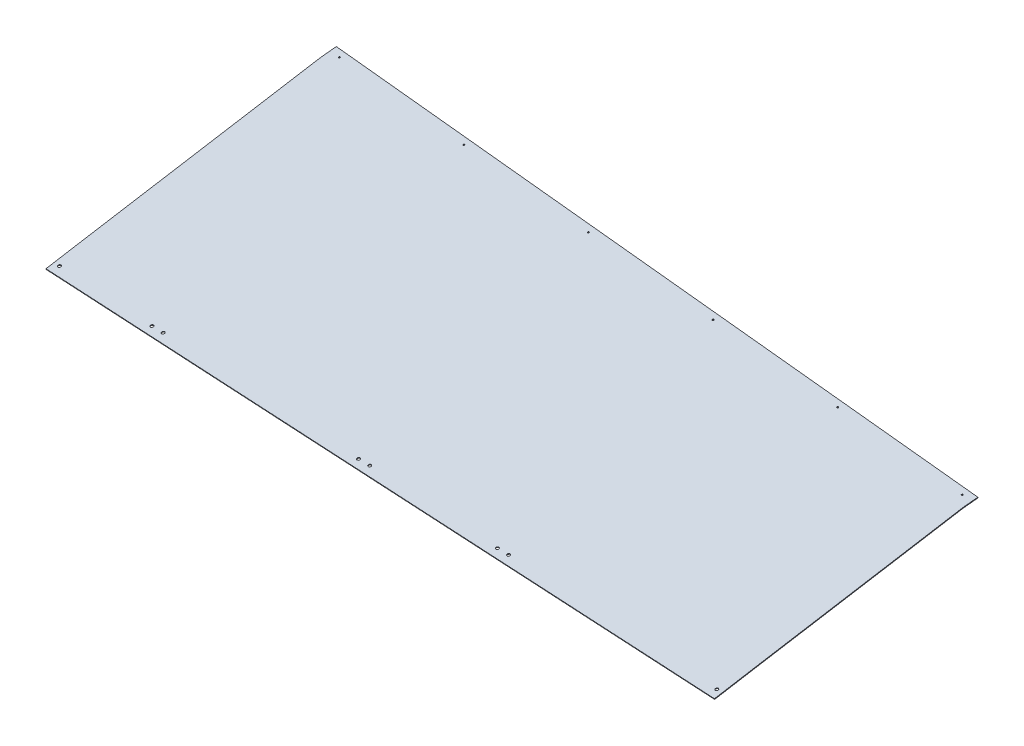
ISO-10303-21;
HEADER;
FILE_DESCRIPTION(('STEP AP214'),'2;1');
FILE_NAME('part.step','',(''),(''),'','','');
FILE_SCHEMA(('AUTOMOTIVE_DESIGN { 1 0 10303 214 1 1 1 1 }'));
ENDSEC;
DATA;
#1=APPLICATION_CONTEXT('core data for automotive mechanical design processes');
#2=APPLICATION_PROTOCOL_DEFINITION('international standard','automotive_design',2000,#1);
#3=PRODUCT_CONTEXT('',#1,'mechanical');
#4=PRODUCT('Part','Part','',(#3));
#5=PRODUCT_RELATED_PRODUCT_CATEGORY('part','',(#4));
#6=PRODUCT_DEFINITION_FORMATION('','',#4);
#7=PRODUCT_DEFINITION_CONTEXT('part definition',#1,'design');
#8=PRODUCT_DEFINITION('design','',#6,#7);
#9=PRODUCT_DEFINITION_SHAPE('','',#8);
#10=(LENGTH_UNIT() NAMED_UNIT(*) SI_UNIT(.MILLI.,.METRE.));
#11=(NAMED_UNIT(*) PLANE_ANGLE_UNIT() SI_UNIT($,.RADIAN.));
#12=(NAMED_UNIT(*) SI_UNIT($,.STERADIAN.) SOLID_ANGLE_UNIT());
#13=UNCERTAINTY_MEASURE_WITH_UNIT(LENGTH_MEASURE(1.E-05),#10,'distance_accuracy_value','');
#14=(GEOMETRIC_REPRESENTATION_CONTEXT(3) GLOBAL_UNCERTAINTY_ASSIGNED_CONTEXT((#13)) GLOBAL_UNIT_ASSIGNED_CONTEXT((#10,
#11,#12)) REPRESENTATION_CONTEXT('',''));
#15=CARTESIAN_POINT('',(0.,0.,0.));
#16=DIRECTION('',(0.,0.,1.));
#17=DIRECTION('',(1.,0.,0.));
#18=AXIS2_PLACEMENT_3D('',#15,#16,#17);
#19=CARTESIAN_POINT('',(6.04000777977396,-300.572395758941,-61.7927019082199));
#20=DIRECTION('',(-0.0196795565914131,0.979325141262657,0.201333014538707));
#21=DIRECTION('',(0.,-0.201372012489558,0.979514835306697));
#22=AXIS2_PLACEMENT_3D('',#19,#20,#21);
#23=PLANE('',#22);
#24=DIRECTION('',(0.0340234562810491,0.201911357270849,-0.978812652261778));
#25=VECTOR('',#24,1.);
#26=CARTESIAN_POINT('',(766.421113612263,-291.126825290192,-33.4134597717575));
#27=LINE('',#26,#25);
#28=CARTESIAN_POINT('',(793.756562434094,-128.905282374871,-819.820429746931));
#29=VERTEX_POINT('',#28);
#30=CARTESIAN_POINT('',(809.057878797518,-38.0999999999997,-1260.02032975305));
#31=VERTEX_POINT('',#30);
#32=EDGE_CURVE('E215',#29,#31,#27,.T.);
#33=ORIENTED_EDGE('',*,*,#32,.F.);
#34=DIRECTION('',(0.0276860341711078,0.201828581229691,-0.979029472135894));
#35=VECTOR('',#34,1.);
#36=CARTESIAN_POINT('',(793.739235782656,-129.031592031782,-819.207727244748));
#37=LINE('',#36,#35);
#38=CARTESIAN_POINT('',(793.739235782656,-129.031592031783,-819.207727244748));
#39=VERTEX_POINT('',#38);
#40=EDGE_CURVE('E142',#39,#29,#37,.T.);
#41=ORIENTED_EDGE('',*,*,#40,.F.);
#42=DIRECTION('',(0.0312390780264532,0.201875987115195,-0.978912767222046));
#43=VECTOR('',#42,1.);
#44=CARTESIAN_POINT('',(767.131724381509,-300.977051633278,14.5695242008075));
#45=LINE('',#44,#43);
#46=CARTESIAN_POINT('',(790.93331339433,-147.164276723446,-731.280892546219));
#47=VERTEX_POINT('',#46);
#48=EDGE_CURVE('E193',#47,#39,#45,.T.);
#49=ORIENTED_EDGE('',*,*,#48,.F.);
#50=DIRECTION('',(-0.998109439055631,-0.00751635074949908,-0.0610004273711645));
#51=VECTOR('',#50,1.);
#52=CARTESIAN_POINT('',(2449.4820662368,-134.674429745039,-629.917075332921));
#53=LINE('',#52,#51);
#54=CARTESIAN_POINT('',(-773.585829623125,-158.946025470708,-826.897998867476));
#55=VERTEX_POINT('',#54);
#56=EDGE_CURVE('E315',#47,#55,#53,.T.);
#57=ORIENTED_EDGE('',*,*,#56,.T.);
#58=DIRECTION('',(0.0312390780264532,0.201875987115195,-0.978912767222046));
#59=VECTOR('',#58,1.);
#60=CARTESIAN_POINT('',(-798.710337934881,-321.307888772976,-39.5923704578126));
#61=LINE('',#60,#59);
#62=CARTESIAN_POINT('',(-771.323454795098,-144.325902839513,-897.792139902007));
#63=VERTEX_POINT('',#62);
#64=EDGE_CURVE('E317',#55,#63,#61,.T.);
#65=ORIENTED_EDGE('',*,*,#64,.T.);
#66=DIRECTION('',(-0.0374160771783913,-0.201952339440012,0.978680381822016));
#67=VECTOR('',#66,1.);
#68=CARTESIAN_POINT('',(-771.30004215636,-144.199533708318,-898.404536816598));
#69=LINE('',#68,#67);
#70=CARTESIAN_POINT('',(-771.300042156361,-144.199533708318,-898.404536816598));
#71=VERTEX_POINT('',#70);
#72=EDGE_CURVE('E310',#71,#63,#69,.T.);
#73=ORIENTED_EDGE('',*,*,#72,.F.);
#74=DIRECTION('',(0.0340234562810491,0.201911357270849,-0.978812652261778));
#75=VECTOR('',#74,1.);
#76=CARTESIAN_POINT('',(-799.335775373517,-310.576896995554,-91.8512530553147));
#77=LINE('',#76,#75);
#78=CARTESIAN_POINT('',(-753.466675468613,-38.3678614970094,-1411.4483852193));
#79=VERTEX_POINT('',#78);
#80=EDGE_CURVE('E380',#71,#79,#77,.T.);
#81=ORIENTED_EDGE('',*,*,#80,.T.);
#82=DIRECTION('',(-0.0952713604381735,-0.202292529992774,0.974679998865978));
#83=VECTOR('',#82,1.);
#84=CARTESIAN_POINT('',(-753.275236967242,-37.9613743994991,-1413.40690955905));
#85=LINE('',#84,#83);
#86=CARTESIAN_POINT('',(-750.502674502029,-32.0743095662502,-1441.77179453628));
#87=VERTEX_POINT('',#86);
#88=EDGE_CURVE('E224',#87,#79,#85,.T.);
#89=ORIENTED_EDGE('',*,*,#88,.F.);
#90=DIRECTION('',(-0.995256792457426,0.,-0.0972826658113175));
#91=VECTOR('',#90,1.);
#92=CARTESIAN_POINT('',(-2549.86215064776,-32.0743095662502,-1617.65251991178));
#93=LINE('',#92,#91);
#94=CARTESIAN_POINT('',(811.895728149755,-32.0743095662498,-1289.05313657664));
#95=VERTEX_POINT('',#94);
#96=EDGE_CURVE('E259',#95,#87,#93,.T.);
#97=ORIENTED_EDGE('',*,*,#96,.F.);
#98=DIRECTION('',(0.095271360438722,0.202292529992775,-0.974679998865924));
#99=VECTOR('',#98,1.);
#100=CARTESIAN_POINT('',(809.057878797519,-38.0999999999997,-1260.02032975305));
#101=LINE('',#100,#99);
#102=EDGE_CURVE('E257',#31,#95,#101,.T.);
#103=ORIENTED_EDGE('',*,*,#102,.F.);
#104=EDGE_LOOP('',(#33,#41,#49,#57,#65,#73,#81,#89,#97,#103));
#105=FACE_BOUND('',#104,.T.);
#106=CARTESIAN_POINT('',(-760.215047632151,-155.332930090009,-843.165892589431));
#107=DIRECTION('',(0.0196795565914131,-0.979325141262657,-0.201333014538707));
#108=DIRECTION('',(-0.00344658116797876,0.201304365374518,-0.979522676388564));
#109=AXIS2_PLACEMENT_3D('',#106,#107,#108);
#110=CIRCLE('',#109,3.17500000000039);
#111=CARTESIAN_POINT('',(-760.225990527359,-154.693788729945,-846.275877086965));
#112=VERTEX_POINT('',#111);
#113=EDGE_CURVE('E332',#112,#112,#110,.T.);
#114=ORIENTED_EDGE('',*,*,#113,.F.);
#115=EDGE_LOOP('',(#114));
#116=FACE_BOUND('',#115,.T.);
#117=CARTESIAN_POINT('',(-543.073211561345,-153.849423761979,-829.157161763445));
#118=DIRECTION('',(0.0196795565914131,-0.979325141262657,-0.201333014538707));
#119=DIRECTION('',(-0.00344658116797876,0.201304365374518,-0.979522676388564));
#120=AXIS2_PLACEMENT_3D('',#117,#118,#119);
#121=CIRCLE('',#120,3.17500000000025);
#122=CARTESIAN_POINT('',(-543.084154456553,-153.210282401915,-832.267146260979));
#123=VERTEX_POINT('',#122);
#124=EDGE_CURVE('E338',#123,#123,#121,.T.);
#125=ORIENTED_EDGE('',*,*,#124,.F.);
#126=EDGE_LOOP('',(#125));
#127=FACE_BOUND('',#126,.T.);
#128=CARTESIAN_POINT('',(-517.688558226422,-153.506566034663,-828.343636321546));
#129=DIRECTION('',(0.0196795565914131,-0.979325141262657,-0.201333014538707));
#130=DIRECTION('',(-0.00344658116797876,0.201304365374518,-0.979522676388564));
#131=AXIS2_PLACEMENT_3D('',#128,#129,#130);
#132=CIRCLE('',#131,3.17500000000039);
#133=CARTESIAN_POINT('',(-517.69950112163,-152.867424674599,-831.45362081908));
#134=VERTEX_POINT('',#133);
#135=EDGE_CURVE('E344',#134,#134,#132,.T.);
#136=ORIENTED_EDGE('',*,*,#135,.F.);
#137=EDGE_LOOP('',(#136));
#138=FACE_BOUND('',#137,.T.);
#139=CARTESIAN_POINT('',(-59.605373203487,-150.208632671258,-799.609526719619));
#140=DIRECTION('',(0.0196795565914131,-0.979325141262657,-0.201333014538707));
#141=DIRECTION('',(-0.00344658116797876,0.201304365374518,-0.979522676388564));
#142=AXIS2_PLACEMENT_3D('',#139,#140,#141);
#143=CIRCLE('',#142,3.17500000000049);
#144=CARTESIAN_POINT('',(-59.6163160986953,-149.569491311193,-802.719511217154));
#145=VERTEX_POINT('',#144);
#146=EDGE_CURVE('E350',#145,#145,#143,.T.);
#147=ORIENTED_EDGE('',*,*,#146,.F.);
#148=EDGE_LOOP('',(#147));
#149=FACE_BOUND('',#148,.T.);
#150=CARTESIAN_POINT('',(-34.2207198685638,-149.865774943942,-798.796001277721));
#151=DIRECTION('',(0.0196795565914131,-0.979325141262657,-0.201333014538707));
#152=DIRECTION('',(-0.00344658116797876,0.201304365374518,-0.979522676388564));
#153=AXIS2_PLACEMENT_3D('',#150,#151,#152);
#154=CIRCLE('',#153,3.17500000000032);
#155=CARTESIAN_POINT('',(-34.2316627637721,-149.226633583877,-801.905985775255));
#156=VERTEX_POINT('',#155);
#157=EDGE_CURVE('E356',#156,#156,#154,.T.);
#158=ORIENTED_EDGE('',*,*,#157,.F.);
#159=EDGE_LOOP('',(#158));
#160=FACE_BOUND('',#159,.T.);
#161=CARTESIAN_POINT('',(265.348419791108,-147.761543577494,-779.749640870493));
#162=DIRECTION('',(0.0196795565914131,-0.979325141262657,-0.201333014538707));
#163=DIRECTION('',(-0.00344658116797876,0.201304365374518,-0.979522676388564));
#164=AXIS2_PLACEMENT_3D('',#161,#162,#163);
#165=CIRCLE('',#164,3.17500000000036);
#166=CARTESIAN_POINT('',(265.337476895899,-147.12240221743,-782.859625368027));
#167=VERTEX_POINT('',#166);
#168=EDGE_CURVE('E362',#167,#167,#165,.T.);
#169=ORIENTED_EDGE('',*,*,#168,.F.);
#170=EDGE_LOOP('',(#169));
#171=FACE_BOUND('',#170,.T.);
#172=CARTESIAN_POINT('',(290.733073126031,-147.418685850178,-778.936115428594));
#173=DIRECTION('',(0.0196795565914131,-0.979325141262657,-0.201333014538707));
#174=DIRECTION('',(-0.00344658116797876,0.201304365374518,-0.979522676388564));
#175=AXIS2_PLACEMENT_3D('',#172,#173,#174);
#176=CIRCLE('',#175,3.17500000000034);
#177=CARTESIAN_POINT('',(290.722130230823,-146.779544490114,-782.046099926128));
#178=VERTEX_POINT('',#177);
#179=EDGE_CURVE('E368',#178,#178,#176,.T.);
#180=ORIENTED_EDGE('',*,*,#179,.F.);
#181=EDGE_LOOP('',(#180));
#182=FACE_BOUND('',#181,.T.);
#183=CARTESIAN_POINT('',(778.933926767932,-143.893949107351,-748.361333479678));
#184=DIRECTION('',(0.0196795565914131,-0.979325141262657,-0.201333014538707));
#185=DIRECTION('',(-0.00344658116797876,0.201304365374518,-0.979522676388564));
#186=AXIS2_PLACEMENT_3D('',#183,#184,#185);
#187=CIRCLE('',#186,3.17500000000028);
#188=CARTESIAN_POINT('',(778.922983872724,-143.254807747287,-751.471317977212));
#189=VERTEX_POINT('',#188);
#190=EDGE_CURVE('E374',#189,#189,#187,.T.);
#191=ORIENTED_EDGE('',*,*,#190,.F.);
#192=EDGE_LOOP('',(#191));
#193=FACE_BOUND('',#192,.T.);
#194=CARTESIAN_POINT('',(-729.09669704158,-34.6434246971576,-1427.18273575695));
#195=DIRECTION('',(0.0196795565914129,-0.979325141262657,-0.201333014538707));
#196=DIRECTION('',(-0.995256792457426,0.,-0.0972826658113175));
#197=AXIS2_PLACEMENT_3D('',#194,#195,#196);
#198=CIRCLE('',#197,1.58750000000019);
#199=CARTESIAN_POINT('',(-730.676667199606,-34.6434246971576,-1427.33717198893));
#200=VERTEX_POINT('',#199);
#201=EDGE_CURVE('E470',#200,#200,#198,.T.);
#202=ORIENTED_EDGE('',*,*,#201,.F.);
#203=EDGE_LOOP('',(#202));
#204=FACE_BOUND('',#203,.T.);
#205=CARTESIAN_POINT('',(-425.742426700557,-34.6434246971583,-1397.53097921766));
#206=DIRECTION('',(0.0196795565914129,-0.979325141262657,-0.201333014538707));
#207=DIRECTION('',(-0.995256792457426,0.,-0.0972826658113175));
#208=AXIS2_PLACEMENT_3D('',#205,#206,#207);
#209=CIRCLE('',#208,1.58749999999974);
#210=CARTESIAN_POINT('',(-427.322396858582,-34.6434246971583,-1397.68541544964));
#211=VERTEX_POINT('',#210);
#212=EDGE_CURVE('E474',#211,#211,#209,.T.);
#213=ORIENTED_EDGE('',*,*,#212,.F.);
#214=EDGE_LOOP('',(#213));
#215=FACE_BOUND('',#214,.T.);
#216=CARTESIAN_POINT('',(-122.388156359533,-34.643424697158,-1367.87922267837));
#217=DIRECTION('',(0.0196795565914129,-0.979325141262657,-0.201333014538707));
#218=DIRECTION('',(-0.995256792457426,0.,-0.0972826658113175));
#219=AXIS2_PLACEMENT_3D('',#216,#217,#218);
#220=CIRCLE('',#219,1.58750000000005);
#221=CARTESIAN_POINT('',(-123.968126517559,-34.643424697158,-1368.03365891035));
#222=VERTEX_POINT('',#221);
#223=EDGE_CURVE('E478',#222,#222,#220,.T.);
#224=ORIENTED_EDGE('',*,*,#223,.F.);
#225=EDGE_LOOP('',(#224));
#226=FACE_BOUND('',#225,.T.);
#227=CARTESIAN_POINT('',(180.96611398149,-34.6434246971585,-1338.22746613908));
#228=DIRECTION('',(0.0196795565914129,-0.979325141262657,-0.201333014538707));
#229=DIRECTION('',(-0.995256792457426,0.,-0.0972826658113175));
#230=AXIS2_PLACEMENT_3D('',#227,#228,#229);
#231=CIRCLE('',#230,1.58750000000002);
#232=CARTESIAN_POINT('',(179.386143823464,-34.6434246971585,-1338.38190237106));
#233=VERTEX_POINT('',#232);
#234=EDGE_CURVE('E482',#233,#233,#231,.T.);
#235=ORIENTED_EDGE('',*,*,#234,.F.);
#236=EDGE_LOOP('',(#235));
#237=FACE_BOUND('',#236,.T.);
#238=CARTESIAN_POINT('',(484.320384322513,-34.6434246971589,-1308.57570959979));
#239=DIRECTION('',(0.0196795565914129,-0.979325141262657,-0.201333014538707));
#240=DIRECTION('',(-0.995256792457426,0.,-0.0972826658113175));
#241=AXIS2_PLACEMENT_3D('',#238,#239,#240);
#242=CIRCLE('',#241,1.58749999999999);
#243=CARTESIAN_POINT('',(482.740414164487,-34.6434246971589,-1308.73014583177));
#244=VERTEX_POINT('',#243);
#245=EDGE_CURVE('E262',#244,#244,#242,.T.);
#246=ORIENTED_EDGE('',*,*,#245,.F.);
#247=EDGE_LOOP('',(#246));
#248=FACE_BOUND('',#247,.T.);
#249=CARTESIAN_POINT('',(787.674654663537,-34.6434246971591,-1278.9239530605));
#250=DIRECTION('',(0.0196795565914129,-0.979325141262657,-0.201333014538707));
#251=DIRECTION('',(-0.995256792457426,0.,-0.0972826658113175));
#252=AXIS2_PLACEMENT_3D('',#249,#250,#251);
#253=CIRCLE('',#252,1.58749999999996);
#254=CARTESIAN_POINT('',(786.094684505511,-34.6434246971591,-1279.07838929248));
#255=VERTEX_POINT('',#254);
#256=EDGE_CURVE('E258',#255,#255,#253,.T.);
#257=ORIENTED_EDGE('',*,*,#256,.F.);
#258=EDGE_LOOP('',(#257));
#259=FACE_BOUND('',#258,.T.);
#260=ADVANCED_FACE('F125',(#105,#116,#127,#138,#149,#160,#171,#182,#193,#204,#215,#226,#237,
#248,#259),#23,.F.);
#261=CARTESIAN_POINT('',(-865.89373133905,3001.58510855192,589.074348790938));
#262=DIRECTION('',(-0.999227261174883,-0.0124125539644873,-0.037293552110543));
#263=DIRECTION('',(-0.0372964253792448,0.,0.999304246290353));
#264=AXIS2_PLACEMENT_3D('',#261,#262,#263);
#265=PLANE('',#264);
#266=ORIENTED_EDGE('',*,*,#80,.F.);
#267=CARTESIAN_POINT('',(-771.30004215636,-144.199533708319,-898.404536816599));
#268=DIRECTION('',(-0.0196795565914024,0.979325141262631,0.201333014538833));
#269=VECTOR('',#268,1.);
#270=LINE('',#267,#269);
#271=CARTESIAN_POINT('',(-771.332033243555,-142.607542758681,-898.077249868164));
#272=VERTEX_POINT('',#271);
#273=EDGE_CURVE('E136',#71,#272,#270,.T.);
#274=ORIENTED_EDGE('',*,*,#273,.T.);
#275=DIRECTION('',(0.0340234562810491,0.201911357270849,-0.978812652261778));
#276=VECTOR('',#275,1.);
#277=CARTESIAN_POINT('',(-799.367766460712,-308.984906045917,-91.5239661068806));
#278=LINE('',#277,#276);
#279=CARTESIAN_POINT('',(-753.498666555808,-36.7758705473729,-1411.12109827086));
#280=VERTEX_POINT('',#279);
#281=EDGE_CURVE('E204',#272,#280,#278,.T.);
#282=ORIENTED_EDGE('',*,*,#281,.T.);
#283=DIRECTION('',(-0.0196795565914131,0.979325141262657,0.201333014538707));
#284=VECTOR('',#283,1.);
#285=CARTESIAN_POINT('',(-753.482671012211,-37.5718660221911,-1411.28474174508));
#286=LINE('',#285,#284);
#287=EDGE_CURVE('E267',#79,#280,#286,.T.);
#288=ORIENTED_EDGE('',*,*,#287,.F.);
#289=EDGE_LOOP('',(#266,#274,#282,#288));
#290=FACE_BOUND('',#289,.T.);
#291=ADVANCED_FACE('F409',(#290),#265,.T.);
#292=CARTESIAN_POINT('',(699.86315764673,3021.03518025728,647.512142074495));
#293=DIRECTION('',(-0.999227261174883,-0.0124125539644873,-0.037293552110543));
#294=DIRECTION('',(-0.0372964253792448,0.,0.999304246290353));
#295=AXIS2_PLACEMENT_3D('',#292,#293,#294);
#296=PLANE('',#295);
#297=CARTESIAN_POINT('',(793.756562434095,-128.905282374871,-819.820429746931));
#298=DIRECTION('',(-0.0196795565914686,0.979325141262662,0.201333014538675));
#299=VECTOR('',#298,1.);
#300=LINE('',#297,#299);
#301=CARTESIAN_POINT('',(793.724571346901,-127.313291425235,-819.493142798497));
#302=VERTEX_POINT('',#301);
#303=EDGE_CURVE('E13',#29,#302,#300,.T.);
#304=ORIENTED_EDGE('',*,*,#303,.F.);
#305=ORIENTED_EDGE('',*,*,#32,.T.);
#306=DIRECTION('',(-0.0196795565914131,0.979325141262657,0.201333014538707));
#307=VECTOR('',#306,1.);
#308=CARTESIAN_POINT('',(809.041883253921,-37.3040045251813,-1259.85668627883));
#309=LINE('',#308,#307);
#310=CARTESIAN_POINT('',(809.025887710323,-36.5080090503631,-1259.69304280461));
#311=VERTEX_POINT('',#310);
#312=EDGE_CURVE('E271',#31,#311,#309,.T.);
#313=ORIENTED_EDGE('',*,*,#312,.T.);
#314=DIRECTION('',(0.0340234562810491,0.201911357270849,-0.978812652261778));
#315=VECTOR('',#314,1.);
#316=CARTESIAN_POINT('',(766.389122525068,-289.534834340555,-33.0861728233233));
#317=LINE('',#316,#315);
#318=EDGE_CURVE('E242',#302,#311,#317,.T.);
#319=ORIENTED_EDGE('',*,*,#318,.F.);
#320=EDGE_LOOP('',(#304,#305,#313,#319));
#321=FACE_BOUND('',#320,.T.);
#322=ADVANCED_FACE('F400',(#321),#296,.F.);
#323=CARTESIAN_POINT('',(6.00801669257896,-298.980404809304,-61.4654149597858));
#324=DIRECTION('',(-0.0196795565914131,0.979325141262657,0.201333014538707));
#325=DIRECTION('',(0.,-0.201372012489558,0.979514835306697));
#326=AXIS2_PLACEMENT_3D('',#323,#324,#325);
#327=PLANE('',#326);
#328=ORIENTED_EDGE('',*,*,#281,.F.);
#329=DIRECTION('',(-0.0374160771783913,-0.201952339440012,0.978680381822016));
#330=VECTOR('',#329,1.);
#331=CARTESIAN_POINT('',(-771.332033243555,-142.607542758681,-898.077249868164));
#332=LINE('',#331,#330);
#333=CARTESIAN_POINT('',(-771.355445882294,-142.733911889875,-897.464852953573));
#334=VERTEX_POINT('',#333);
#335=EDGE_CURVE('E421',#272,#334,#332,.T.);
#336=ORIENTED_EDGE('',*,*,#335,.T.);
#337=DIRECTION('',(0.0312390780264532,0.201875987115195,-0.978912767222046));
#338=VECTOR('',#337,1.);
#339=CARTESIAN_POINT('',(-798.742329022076,-319.715897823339,-39.2650835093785));
#340=LINE('',#339,#338);
#341=CARTESIAN_POINT('',(-773.61782071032,-157.354034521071,-826.570711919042));
#342=VERTEX_POINT('',#341);
#343=EDGE_CURVE('E151',#342,#334,#340,.T.);
#344=ORIENTED_EDGE('',*,*,#343,.F.);
#345=DIRECTION('',(-0.998109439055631,-0.00751635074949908,-0.0610004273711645));
#346=VECTOR('',#345,1.);
#347=CARTESIAN_POINT('',(2449.4500751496,-133.082438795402,-629.589788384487));
#348=LINE('',#347,#346);
#349=CARTESIAN_POINT('',(790.901322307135,-145.572285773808,-730.953605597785));
#350=VERTEX_POINT('',#349);
#351=EDGE_CURVE('E330',#350,#342,#348,.T.);
#352=ORIENTED_EDGE('',*,*,#351,.F.);
#353=DIRECTION('',(0.0312390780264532,0.201875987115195,-0.978912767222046));
#354=VECTOR('',#353,1.);
#355=CARTESIAN_POINT('',(767.099733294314,-299.385060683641,14.8968111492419));
#356=LINE('',#355,#354);
#357=CARTESIAN_POINT('',(793.707244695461,-127.439601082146,-818.880440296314));
#358=VERTEX_POINT('',#357);
#359=EDGE_CURVE('E175',#350,#358,#356,.T.);
#360=ORIENTED_EDGE('',*,*,#359,.T.);
#361=DIRECTION('',(0.0276860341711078,0.201828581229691,-0.979029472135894));
#362=VECTOR('',#361,1.);
#363=CARTESIAN_POINT('',(793.707244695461,-127.439601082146,-818.880440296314));
#364=LINE('',#363,#362);
#365=EDGE_CURVE('E385',#358,#302,#364,.T.);
#366=ORIENTED_EDGE('',*,*,#365,.T.);
#367=ORIENTED_EDGE('',*,*,#318,.T.);
#368=DIRECTION('',(0.095271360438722,0.202292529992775,-0.974679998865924));
#369=VECTOR('',#368,1.);
#370=CARTESIAN_POINT('',(809.025887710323,-36.5080090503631,-1259.69304280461));
#371=LINE('',#370,#369);
#372=CARTESIAN_POINT('',(811.86373706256,-30.4823186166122,-1288.7258496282));
#373=VERTEX_POINT('',#372);
#374=EDGE_CURVE('E235',#311,#373,#371,.T.);
#375=ORIENTED_EDGE('',*,*,#374,.T.);
#376=DIRECTION('',(-0.995256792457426,0.,-0.0972826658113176));
#377=VECTOR('',#376,1.);
#378=CARTESIAN_POINT('',(132.459438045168,-30.4823186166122,-1355.13510387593));
#379=LINE('',#378,#377);
#380=CARTESIAN_POINT('',(-750.534665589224,-30.4823186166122,-1441.44450758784));
#381=VERTEX_POINT('',#380);
#382=EDGE_CURVE('E239',#373,#381,#379,.T.);
#383=ORIENTED_EDGE('',*,*,#382,.T.);
#384=DIRECTION('',(-0.0952713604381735,-0.202292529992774,0.974679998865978));
#385=VECTOR('',#384,1.);
#386=CARTESIAN_POINT('',(-753.307228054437,-36.3693834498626,-1413.07962261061));
#387=LINE('',#386,#385);
#388=EDGE_CURVE('E245',#381,#280,#387,.T.);
#389=ORIENTED_EDGE('',*,*,#388,.T.);
#390=EDGE_LOOP('',(#328,#336,#344,#352,#360,#366,#367,#375,#383,#389));
#391=FACE_BOUND('',#390,.T.);
#392=CARTESIAN_POINT('',(-760.247038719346,-153.740939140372,-842.838605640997));
#393=DIRECTION('',(-0.0196795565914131,0.979325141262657,0.201333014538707));
#394=DIRECTION('',(0.00344658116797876,-0.201304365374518,0.979522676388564));
#395=AXIS2_PLACEMENT_3D('',#392,#393,#394);
#396=CIRCLE('',#395,3.17500000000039);
#397=CARTESIAN_POINT('',(-760.236095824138,-154.380080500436,-839.728621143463));
#398=VERTEX_POINT('',#397);
#399=EDGE_CURVE('E335',#398,#398,#396,.T.);
#400=ORIENTED_EDGE('',*,*,#399,.F.);
#401=EDGE_LOOP('',(#400));
#402=FACE_BOUND('',#401,.T.);
#403=CARTESIAN_POINT('',(-543.10520264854,-152.257432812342,-828.829874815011));
#404=DIRECTION('',(-0.0196795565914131,0.979325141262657,0.201333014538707));
#405=DIRECTION('',(0.00344658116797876,-0.201304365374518,0.979522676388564));
#406=AXIS2_PLACEMENT_3D('',#403,#404,#405);
#407=CIRCLE('',#406,3.17500000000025);
#408=CARTESIAN_POINT('',(-543.094259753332,-152.896574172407,-825.719890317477));
#409=VERTEX_POINT('',#408);
#410=EDGE_CURVE('E341',#409,#409,#407,.T.);
#411=ORIENTED_EDGE('',*,*,#410,.F.);
#412=EDGE_LOOP('',(#411));
#413=FACE_BOUND('',#412,.T.);
#414=CARTESIAN_POINT('',(-517.720549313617,-151.914575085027,-828.016349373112));
#415=DIRECTION('',(-0.0196795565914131,0.979325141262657,0.201333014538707));
#416=DIRECTION('',(0.00344658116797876,-0.201304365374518,0.979522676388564));
#417=AXIS2_PLACEMENT_3D('',#414,#415,#416);
#418=CIRCLE('',#417,3.17500000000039);
#419=CARTESIAN_POINT('',(-517.709606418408,-152.553716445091,-824.906364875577));
#420=VERTEX_POINT('',#419);
#421=EDGE_CURVE('E347',#420,#420,#418,.T.);
#422=ORIENTED_EDGE('',*,*,#421,.F.);
#423=EDGE_LOOP('',(#422));
#424=FACE_BOUND('',#423,.T.);
#425=CARTESIAN_POINT('',(-59.637364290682,-148.616641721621,-799.282239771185));
#426=DIRECTION('',(-0.0196795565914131,0.979325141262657,0.201333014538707));
#427=DIRECTION('',(0.00344658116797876,-0.201304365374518,0.979522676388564));
#428=AXIS2_PLACEMENT_3D('',#425,#426,#427);
#429=CIRCLE('',#428,3.17500000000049);
#430=CARTESIAN_POINT('',(-59.6264213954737,-149.255783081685,-796.172255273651));
#431=VERTEX_POINT('',#430);
#432=EDGE_CURVE('E353',#431,#431,#429,.T.);
#433=ORIENTED_EDGE('',*,*,#432,.F.);
#434=EDGE_LOOP('',(#433));
#435=FACE_BOUND('',#434,.T.);
#436=CARTESIAN_POINT('',(-34.2527109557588,-148.273783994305,-798.468714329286));
#437=DIRECTION('',(-0.0196795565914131,0.979325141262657,0.201333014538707));
#438=DIRECTION('',(0.00344658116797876,-0.201304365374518,0.979522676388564));
#439=AXIS2_PLACEMENT_3D('',#436,#437,#438);
#440=CIRCLE('',#439,3.17500000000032);
#441=CARTESIAN_POINT('',(-34.2417680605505,-148.912925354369,-795.358729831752));
#442=VERTEX_POINT('',#441);
#443=EDGE_CURVE('E359',#442,#442,#440,.T.);
#444=ORIENTED_EDGE('',*,*,#443,.F.);
#445=EDGE_LOOP('',(#444));
#446=FACE_BOUND('',#445,.T.);
#447=CARTESIAN_POINT('',(265.316428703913,-146.169552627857,-779.422353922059));
#448=DIRECTION('',(-0.0196795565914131,0.979325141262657,0.201333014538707));
#449=DIRECTION('',(0.00344658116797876,-0.201304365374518,0.979522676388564));
#450=AXIS2_PLACEMENT_3D('',#447,#448,#449);
#451=CIRCLE('',#450,3.17500000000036);
#452=CARTESIAN_POINT('',(265.327371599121,-146.808693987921,-776.312369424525));
#453=VERTEX_POINT('',#452);
#454=EDGE_CURVE('E365',#453,#453,#451,.T.);
#455=ORIENTED_EDGE('',*,*,#454,.F.);
#456=EDGE_LOOP('',(#455));
#457=FACE_BOUND('',#456,.T.);
#458=CARTESIAN_POINT('',(290.701082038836,-145.826694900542,-778.608828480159));
#459=DIRECTION('',(-0.0196795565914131,0.979325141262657,0.201333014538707));
#460=DIRECTION('',(0.00344658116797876,-0.201304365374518,0.979522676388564));
#461=AXIS2_PLACEMENT_3D('',#458,#459,#460);
#462=CIRCLE('',#461,3.17500000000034);
#463=CARTESIAN_POINT('',(290.712024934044,-146.465836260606,-775.498843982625));
#464=VERTEX_POINT('',#463);
#465=EDGE_CURVE('E371',#464,#464,#462,.T.);
#466=ORIENTED_EDGE('',*,*,#465,.F.);
#467=EDGE_LOOP('',(#466));
#468=FACE_BOUND('',#467,.T.);
#469=CARTESIAN_POINT('',(778.901935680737,-142.301958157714,-748.034046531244));
#470=DIRECTION('',(-0.0196795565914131,0.979325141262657,0.201333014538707));
#471=DIRECTION('',(0.00344658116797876,-0.201304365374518,0.979522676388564));
#472=AXIS2_PLACEMENT_3D('',#469,#470,#471);
#473=CIRCLE('',#472,3.17500000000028);
#474=CARTESIAN_POINT('',(778.912878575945,-142.941099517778,-744.92406203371));
#475=VERTEX_POINT('',#474);
#476=EDGE_CURVE('E377',#475,#475,#473,.T.);
#477=ORIENTED_EDGE('',*,*,#476,.F.);
#478=EDGE_LOOP('',(#477));
#479=FACE_BOUND('',#478,.T.);
#480=CARTESIAN_POINT('',(-729.128688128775,-33.051433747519,-1426.85544880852));
#481=DIRECTION('',(0.019679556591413,-0.979325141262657,-0.201333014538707));
#482=DIRECTION('',(-0.995256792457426,0.,-0.0972826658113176));
#483=AXIS2_PLACEMENT_3D('',#480,#481,#482);
#484=CIRCLE('',#483,1.58750000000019);
#485=CARTESIAN_POINT('',(-730.708658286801,-33.051433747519,-1427.0098850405));
#486=VERTEX_POINT('',#485);
#487=EDGE_CURVE('E511',#486,#486,#484,.T.);
#488=ORIENTED_EDGE('',*,*,#487,.T.);
#489=EDGE_LOOP('',(#488));
#490=FACE_BOUND('',#489,.T.);
#491=CARTESIAN_POINT('',(-425.774417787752,-33.0514337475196,-1397.20369226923));
#492=DIRECTION('',(0.019679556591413,-0.979325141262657,-0.201333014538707));
#493=DIRECTION('',(-0.995256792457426,0.,-0.0972826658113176));
#494=AXIS2_PLACEMENT_3D('',#491,#492,#493);
#495=CIRCLE('',#494,1.58749999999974);
#496=CARTESIAN_POINT('',(-427.354387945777,-33.0514337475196,-1397.3581285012));
#497=VERTEX_POINT('',#496);
#498=EDGE_CURVE('E508',#497,#497,#495,.T.);
#499=ORIENTED_EDGE('',*,*,#498,.T.);
#500=EDGE_LOOP('',(#499));
#501=FACE_BOUND('',#500,.T.);
#502=CARTESIAN_POINT('',(-122.420147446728,-33.0514337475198,-1367.55193572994));
#503=DIRECTION('',(0.019679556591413,-0.979325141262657,-0.201333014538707));
#504=DIRECTION('',(-0.995256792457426,0.,-0.0972826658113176));
#505=AXIS2_PLACEMENT_3D('',#502,#503,#504);
#506=CIRCLE('',#505,1.58750000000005);
#507=CARTESIAN_POINT('',(-124.000117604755,-33.0514337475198,-1367.70637196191));
#508=VERTEX_POINT('',#507);
#509=EDGE_CURVE('E505',#508,#508,#506,.T.);
#510=ORIENTED_EDGE('',*,*,#509,.T.);
#511=EDGE_LOOP('',(#510));
#512=FACE_BOUND('',#511,.T.);
#513=CARTESIAN_POINT('',(180.934122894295,-33.0514337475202,-1337.90017919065));
#514=DIRECTION('',(0.019679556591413,-0.979325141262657,-0.201333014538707));
#515=DIRECTION('',(-0.995256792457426,0.,-0.0972826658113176));
#516=AXIS2_PLACEMENT_3D('',#513,#514,#515);
#517=CIRCLE('',#516,1.58750000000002);
#518=CARTESIAN_POINT('',(179.354152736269,-33.0514337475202,-1338.05461542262));
#519=VERTEX_POINT('',#518);
#520=EDGE_CURVE('E499',#519,#519,#517,.T.);
#521=ORIENTED_EDGE('',*,*,#520,.T.);
#522=EDGE_LOOP('',(#521));
#523=FACE_BOUND('',#522,.T.);
#524=CARTESIAN_POINT('',(484.288393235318,-33.0514337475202,-1308.24842265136));
#525=DIRECTION('',(0.019679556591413,-0.979325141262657,-0.201333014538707));
#526=DIRECTION('',(-0.995256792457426,0.,-0.0972826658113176));
#527=AXIS2_PLACEMENT_3D('',#524,#525,#526);
#528=CIRCLE('',#527,1.58749999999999);
#529=CARTESIAN_POINT('',(482.708423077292,-33.0514337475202,-1308.40285888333));
#530=VERTEX_POINT('',#529);
#531=EDGE_CURVE('E496',#530,#530,#528,.T.);
#532=ORIENTED_EDGE('',*,*,#531,.T.);
#533=EDGE_LOOP('',(#532));
#534=FACE_BOUND('',#533,.T.);
#535=CARTESIAN_POINT('',(787.642663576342,-33.0514337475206,-1278.59666611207));
#536=DIRECTION('',(0.019679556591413,-0.979325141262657,-0.201333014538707));
#537=DIRECTION('',(-0.995256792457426,0.,-0.0972826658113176));
#538=AXIS2_PLACEMENT_3D('',#535,#536,#537);
#539=CIRCLE('',#538,1.58749999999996);
#540=CARTESIAN_POINT('',(786.062693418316,-33.0514337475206,-1278.75110234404));
#541=VERTEX_POINT('',#540);
#542=EDGE_CURVE('E253',#541,#541,#539,.T.);
#543=ORIENTED_EDGE('',*,*,#542,.T.);
#544=EDGE_LOOP('',(#543));
#545=FACE_BOUND('',#544,.T.);
#546=ADVANCED_FACE('F127',(#391,#402,#413,#424,#435,#446,#457,#468,#479,#490,#501,#512,#523,
#534,#545),#327,.T.);
#547=CARTESIAN_POINT('',(-771.316037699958,-143.403538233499,-898.240893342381));
#548=DIRECTION('',(-0.999105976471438,-0.0117269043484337,-0.0406168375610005));
#549=DIRECTION('',(-0.0374160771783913,-0.201952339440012,0.978680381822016));
#550=AXIS2_PLACEMENT_3D('',#547,#548,#549);
#551=PLANE('',#550);
#552=ORIENTED_EDGE('',*,*,#273,.F.);
#553=ORIENTED_EDGE('',*,*,#72,.T.);
#554=CARTESIAN_POINT('',(-771.323454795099,-144.325902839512,-897.792139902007));
#555=DIRECTION('',(-0.0196795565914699,0.979325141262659,0.201333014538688));
#556=VECTOR('',#555,1.);
#557=LINE('',#554,#556);
#558=EDGE_CURVE('E277',#63,#334,#557,.T.);
#559=ORIENTED_EDGE('',*,*,#558,.T.);
#560=ORIENTED_EDGE('',*,*,#335,.F.);
#561=EDGE_LOOP('',(#552,#553,#559,#560));
#562=FACE_BOUND('',#561,.T.);
#563=ADVANCED_FACE('F299',(#562),#551,.T.);
#564=CARTESIAN_POINT('',(793.723240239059,-128.235596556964,-819.044083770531));
#565=DIRECTION('',(0.999422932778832,0.0136927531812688,0.0310855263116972));
#566=DIRECTION('',(0.0276860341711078,0.201828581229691,-0.979029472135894));
#567=AXIS2_PLACEMENT_3D('',#564,#565,#566);
#568=PLANE('',#567);
#569=ORIENTED_EDGE('',*,*,#40,.T.);
#570=ORIENTED_EDGE('',*,*,#303,.T.);
#571=ORIENTED_EDGE('',*,*,#365,.F.);
#572=CARTESIAN_POINT('',(793.739235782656,-129.031592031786,-819.207727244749));
#573=DIRECTION('',(-0.0196795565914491,0.979325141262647,0.201333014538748));
#574=VECTOR('',#573,1.);
#575=LINE('',#572,#574);
#576=EDGE_CURVE('E273',#39,#358,#575,.T.);
#577=ORIENTED_EDGE('',*,*,#576,.F.);
#578=EDGE_LOOP('',(#569,#570,#571,#577));
#579=FACE_BOUND('',#578,.T.);
#580=ADVANCED_FACE('F430',(#579),#568,.T.);
#581=CARTESIAN_POINT('',(778.88394069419,-141.406463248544,-747.849947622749));
#582=DIRECTION('',(0.0196795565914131,-0.979325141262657,-0.201333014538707));
#583=DIRECTION('',(-0.00344658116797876,0.201304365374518,-0.979522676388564));
#584=AXIS2_PLACEMENT_3D('',#581,#582,#583);
#585=CYLINDRICAL_SURFACE('',#584,3.17500000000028);
#586=ORIENTED_EDGE('',*,*,#476,.T.);
#587=EDGE_LOOP('',(#586));
#588=FACE_BOUND('',#587,.T.);
#589=ORIENTED_EDGE('',*,*,#190,.T.);
#590=EDGE_LOOP('',(#589));
#591=FACE_BOUND('',#590,.T.);
#592=ADVANCED_FACE('F438',(#588,#591),#585,.F.);
#593=CARTESIAN_POINT('',(290.683087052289,-144.931199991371,-778.424729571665));
#594=DIRECTION('',(0.0196795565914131,-0.979325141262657,-0.201333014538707));
#595=DIRECTION('',(-0.00344658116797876,0.201304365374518,-0.979522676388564));
#596=AXIS2_PLACEMENT_3D('',#593,#594,#595);
#597=CYLINDRICAL_SURFACE('',#596,3.17500000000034);
#598=ORIENTED_EDGE('',*,*,#465,.T.);
#599=EDGE_LOOP('',(#598));
#600=FACE_BOUND('',#599,.T.);
#601=ORIENTED_EDGE('',*,*,#179,.T.);
#602=EDGE_LOOP('',(#601));
#603=FACE_BOUND('',#602,.T.);
#604=ADVANCED_FACE('F444',(#600,#603),#597,.F.);
#605=CARTESIAN_POINT('',(265.298433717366,-145.274057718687,-779.238255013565));
#606=DIRECTION('',(0.0196795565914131,-0.979325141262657,-0.201333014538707));
#607=DIRECTION('',(-0.00344658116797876,0.201304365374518,-0.979522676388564));
#608=AXIS2_PLACEMENT_3D('',#605,#606,#607);
#609=CYLINDRICAL_SURFACE('',#608,3.17500000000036);
#610=ORIENTED_EDGE('',*,*,#454,.T.);
#611=EDGE_LOOP('',(#610));
#612=FACE_BOUND('',#611,.T.);
#613=ORIENTED_EDGE('',*,*,#168,.T.);
#614=EDGE_LOOP('',(#613));
#615=FACE_BOUND('',#614,.T.);
#616=ADVANCED_FACE('F560',(#612,#615),#609,.F.);
#617=CARTESIAN_POINT('',(-34.2707059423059,-147.378289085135,-798.284615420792));
#618=DIRECTION('',(0.0196795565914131,-0.979325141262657,-0.201333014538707));
#619=DIRECTION('',(-0.00344658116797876,0.201304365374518,-0.979522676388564));
#620=AXIS2_PLACEMENT_3D('',#617,#618,#619);
#621=CYLINDRICAL_SURFACE('',#620,3.17500000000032);
#622=ORIENTED_EDGE('',*,*,#443,.T.);
#623=EDGE_LOOP('',(#622));
#624=FACE_BOUND('',#623,.T.);
#625=ORIENTED_EDGE('',*,*,#157,.T.);
#626=EDGE_LOOP('',(#625));
#627=FACE_BOUND('',#626,.T.);
#628=ADVANCED_FACE('F570',(#624,#627),#621,.F.);
#629=CARTESIAN_POINT('',(-59.6553592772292,-147.72114681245,-799.098140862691));
#630=DIRECTION('',(0.0196795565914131,-0.979325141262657,-0.201333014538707));
#631=DIRECTION('',(-0.00344658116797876,0.201304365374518,-0.979522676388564));
#632=AXIS2_PLACEMENT_3D('',#629,#630,#631);
#633=CYLINDRICAL_SURFACE('',#632,3.17500000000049);
#634=ORIENTED_EDGE('',*,*,#432,.T.);
#635=EDGE_LOOP('',(#634));
#636=FACE_BOUND('',#635,.T.);
#637=ORIENTED_EDGE('',*,*,#146,.T.);
#638=EDGE_LOOP('',(#637));
#639=FACE_BOUND('',#638,.T.);
#640=ADVANCED_FACE('F580',(#636,#639),#633,.F.);
#641=CARTESIAN_POINT('',(-517.738544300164,-151.019080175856,-827.832250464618));
#642=DIRECTION('',(0.0196795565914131,-0.979325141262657,-0.201333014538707));
#643=DIRECTION('',(-0.00344658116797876,0.201304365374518,-0.979522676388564));
#644=AXIS2_PLACEMENT_3D('',#641,#642,#643);
#645=CYLINDRICAL_SURFACE('',#644,3.17500000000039);
#646=ORIENTED_EDGE('',*,*,#421,.T.);
#647=EDGE_LOOP('',(#646));
#648=FACE_BOUND('',#647,.T.);
#649=ORIENTED_EDGE('',*,*,#135,.T.);
#650=EDGE_LOOP('',(#649));
#651=FACE_BOUND('',#650,.T.);
#652=ADVANCED_FACE('F590',(#648,#651),#645,.F.);
#653=CARTESIAN_POINT('',(-543.123197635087,-151.361937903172,-828.645775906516));
#654=DIRECTION('',(0.0196795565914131,-0.979325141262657,-0.201333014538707));
#655=DIRECTION('',(-0.00344658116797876,0.201304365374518,-0.979522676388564));
#656=AXIS2_PLACEMENT_3D('',#653,#654,#655);
#657=CYLINDRICAL_SURFACE('',#656,3.17500000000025);
#658=ORIENTED_EDGE('',*,*,#410,.T.);
#659=EDGE_LOOP('',(#658));
#660=FACE_BOUND('',#659,.T.);
#661=ORIENTED_EDGE('',*,*,#124,.T.);
#662=EDGE_LOOP('',(#661));
#663=FACE_BOUND('',#662,.T.);
#664=ADVANCED_FACE('F600',(#660,#663),#657,.F.);
#665=CARTESIAN_POINT('',(-760.265033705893,-152.845444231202,-842.654506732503));
#666=DIRECTION('',(0.0196795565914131,-0.979325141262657,-0.201333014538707));
#667=DIRECTION('',(-0.00344658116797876,0.201304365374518,-0.979522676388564));
#668=AXIS2_PLACEMENT_3D('',#665,#666,#667);
#669=CYLINDRICAL_SURFACE('',#668,3.17500000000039);
#670=ORIENTED_EDGE('',*,*,#399,.T.);
#671=EDGE_LOOP('',(#670));
#672=FACE_BOUND('',#671,.T.);
#673=ORIENTED_EDGE('',*,*,#113,.T.);
#674=EDGE_LOOP('',(#673));
#675=FACE_BOUND('',#674,.T.);
#676=ADVANCED_FACE('F610',(#672,#675),#669,.F.);
#677=CARTESIAN_POINT('',(2387.40322350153,2954.59087705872,5.18466026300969));
#678=DIRECTION('',(-0.0582259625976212,-0.202152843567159,0.977621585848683));
#679=DIRECTION('',(0.,-0.979283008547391,-0.202496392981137));
#680=AXIS2_PLACEMENT_3D('',#677,#678,#679);
#681=PLANE('',#680);
#682=ORIENTED_EDGE('',*,*,#56,.F.);
#683=DIRECTION('',(0.0196795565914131,-0.979325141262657,-0.201333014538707));
#684=VECTOR('',#683,1.);
#685=CARTESIAN_POINT('',(728.854470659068,2942.10103008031,-96.1791569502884));
#686=LINE('',#685,#684);
#687=EDGE_CURVE('E311',#350,#47,#686,.T.);
#688=ORIENTED_EDGE('',*,*,#687,.F.);
#689=ORIENTED_EDGE('',*,*,#351,.T.);
#690=DIRECTION('',(0.0196795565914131,-0.979325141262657,-0.201333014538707));
#691=VECTOR('',#690,1.);
#692=CARTESIAN_POINT('',(-835.664672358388,2930.31928133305,-191.796263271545));
#693=LINE('',#692,#691);
#694=EDGE_CURVE('E325',#342,#55,#693,.T.);
#695=ORIENTED_EDGE('',*,*,#694,.T.);
#696=EDGE_LOOP('',(#682,#688,#689,#695));
#697=FACE_BOUND('',#696,.T.);
#698=ADVANCED_FACE('F294',(#697),#681,.T.);
#699=CARTESIAN_POINT('',(-860.789180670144,2767.95741803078,595.509365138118));
#700=DIRECTION('',(-0.999318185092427,-0.0129751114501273,-0.0345660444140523));
#701=DIRECTION('',(-0.0345689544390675,0.,0.999402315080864));
#702=AXIS2_PLACEMENT_3D('',#699,#700,#701);
#703=PLANE('',#702);
#704=ORIENTED_EDGE('',*,*,#64,.F.);
#705=ORIENTED_EDGE('',*,*,#694,.F.);
#706=ORIENTED_EDGE('',*,*,#343,.T.);
#707=ORIENTED_EDGE('',*,*,#558,.F.);
#708=EDGE_LOOP('',(#704,#705,#706,#707));
#709=FACE_BOUND('',#708,.T.);
#710=ADVANCED_FACE('F283',(#709),#703,.T.);
#711=CARTESIAN_POINT('',(705.052881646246,2788.28825517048,649.671259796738));
#712=DIRECTION('',(-0.999318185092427,-0.0129751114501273,-0.0345660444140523));
#713=DIRECTION('',(-0.0345689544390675,0.,0.999402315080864));
#714=AXIS2_PLACEMENT_3D('',#711,#712,#713);
#715=PLANE('',#714);
#716=ORIENTED_EDGE('',*,*,#687,.T.);
#717=ORIENTED_EDGE('',*,*,#48,.T.);
#718=ORIENTED_EDGE('',*,*,#576,.T.);
#719=ORIENTED_EDGE('',*,*,#359,.F.);
#720=EDGE_LOOP('',(#716,#717,#718,#719));
#721=FACE_BOUND('',#720,.T.);
#722=ADVANCED_FACE('F293',(#721),#715,.F.);
#723=CARTESIAN_POINT('',(809.041883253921,-37.3040045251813,-1259.85668627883));
#724=DIRECTION('',(0.995256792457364,-1.31204147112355E-13,0.0972826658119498));
#725=DIRECTION('',(0.095271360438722,0.202292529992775,-0.974679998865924));
#726=AXIS2_PLACEMENT_3D('',#723,#724,#725);
#727=PLANE('',#726);
#728=ORIENTED_EDGE('',*,*,#312,.F.);
#729=ORIENTED_EDGE('',*,*,#102,.T.);
#730=DIRECTION('',(0.019679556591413,-0.979325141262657,-0.201333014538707));
#731=VECTOR('',#730,1.);
#732=CARTESIAN_POINT('',(749.848635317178,3055.61100849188,-654.276220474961));
#733=LINE('',#732,#731);
#734=EDGE_CURVE('E251',#373,#95,#733,.T.);
#735=ORIENTED_EDGE('',*,*,#734,.F.);
#736=ORIENTED_EDGE('',*,*,#374,.F.);
#737=EDGE_LOOP('',(#728,#729,#735,#736));
#738=FACE_BOUND('',#737,.T.);
#739=ADVANCED_FACE('F255',(#738),#727,.T.);
#740=CARTESIAN_POINT('',(-753.29123251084,-37.1653789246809,-1413.24326608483));
#741=DIRECTION('',(-0.995256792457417,0.,-0.0972826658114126));
#742=DIRECTION('',(-0.0952713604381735,-0.202292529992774,0.974679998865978));
#743=AXIS2_PLACEMENT_3D('',#740,#741,#742);
#744=PLANE('',#743);
#745=ORIENTED_EDGE('',*,*,#388,.F.);
#746=DIRECTION('',(0.019679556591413,-0.979325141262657,-0.201333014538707));
#747=VECTOR('',#746,1.);
#748=CARTESIAN_POINT('',(-812.549767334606,3055.61100849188,-806.994878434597));
#749=LINE('',#748,#747);
#750=EDGE_CURVE('E252',#381,#87,#749,.T.);
#751=ORIENTED_EDGE('',*,*,#750,.T.);
#752=ORIENTED_EDGE('',*,*,#88,.T.);
#753=ORIENTED_EDGE('',*,*,#287,.T.);
#754=EDGE_LOOP('',(#745,#751,#752,#753));
#755=FACE_BOUND('',#754,.T.);
#756=ADVANCED_FACE('F650',(#755),#744,.T.);
#757=CARTESIAN_POINT('',(70.4443362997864,3055.61100849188,-720.685474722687));
#758=DIRECTION('',(-0.0952713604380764,-0.202292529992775,0.974679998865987));
#759=DIRECTION('',(0.,-0.979133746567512,-0.203216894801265));
#760=AXIS2_PLACEMENT_3D('',#757,#758,#759);
#761=PLANE('',#760);
#762=ORIENTED_EDGE('',*,*,#96,.T.);
#763=ORIENTED_EDGE('',*,*,#750,.F.);
#764=ORIENTED_EDGE('',*,*,#382,.F.);
#765=ORIENTED_EDGE('',*,*,#734,.T.);
#766=EDGE_LOOP('',(#762,#763,#764,#765));
#767=FACE_BOUND('',#766,.T.);
#768=ADVANCED_FACE('F250',(#767),#761,.F.);
#769=CARTESIAN_POINT('',(787.624668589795,-32.1559388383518,-1278.41256720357));
#770=DIRECTION('',(0.0196795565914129,-0.979325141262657,-0.201333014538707));
#771=DIRECTION('',(-0.995256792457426,0.,-0.0972826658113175));
#772=AXIS2_PLACEMENT_3D('',#769,#770,#771);
#773=CYLINDRICAL_SURFACE('',#772,1.58749999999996);
#774=ORIENTED_EDGE('',*,*,#256,.T.);
#775=EDGE_LOOP('',(#774));
#776=FACE_BOUND('',#775,.T.);
#777=ORIENTED_EDGE('',*,*,#542,.F.);
#778=EDGE_LOOP('',(#777));
#779=FACE_BOUND('',#778,.T.);
#780=ADVANCED_FACE('F488',(#776,#779),#773,.F.);
#781=CARTESIAN_POINT('',(484.270398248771,-32.1559388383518,-1308.06432374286));
#782=DIRECTION('',(0.0196795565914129,-0.979325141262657,-0.201333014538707));
#783=DIRECTION('',(-0.995256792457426,0.,-0.0972826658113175));
#784=AXIS2_PLACEMENT_3D('',#781,#782,#783);
#785=CYLINDRICAL_SURFACE('',#784,1.58749999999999);
#786=ORIENTED_EDGE('',*,*,#245,.T.);
#787=EDGE_LOOP('',(#786));
#788=FACE_BOUND('',#787,.T.);
#789=ORIENTED_EDGE('',*,*,#531,.F.);
#790=EDGE_LOOP('',(#789));
#791=FACE_BOUND('',#790,.T.);
#792=ADVANCED_FACE('F491',(#788,#791),#785,.F.);
#793=CARTESIAN_POINT('',(180.916127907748,-32.1559388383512,-1337.71608028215));
#794=DIRECTION('',(0.0196795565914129,-0.979325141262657,-0.201333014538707));
#795=DIRECTION('',(-0.995256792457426,0.,-0.0972826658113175));
#796=AXIS2_PLACEMENT_3D('',#793,#794,#795);
#797=CYLINDRICAL_SURFACE('',#796,1.58750000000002);
#798=ORIENTED_EDGE('',*,*,#234,.T.);
#799=EDGE_LOOP('',(#798));
#800=FACE_BOUND('',#799,.T.);
#801=ORIENTED_EDGE('',*,*,#520,.F.);
#802=EDGE_LOOP('',(#801));
#803=FACE_BOUND('',#802,.T.);
#804=ADVANCED_FACE('F520',(#800,#803),#797,.F.);
#805=CARTESIAN_POINT('',(-122.438142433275,-32.1559388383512,-1367.36783682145));
#806=DIRECTION('',(0.0196795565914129,-0.979325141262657,-0.201333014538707));
#807=DIRECTION('',(-0.995256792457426,0.,-0.0972826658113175));
#808=AXIS2_PLACEMENT_3D('',#805,#806,#807);
#809=CYLINDRICAL_SURFACE('',#808,1.58750000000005);
#810=ORIENTED_EDGE('',*,*,#223,.T.);
#811=EDGE_LOOP('',(#810));
#812=FACE_BOUND('',#811,.T.);
#813=ORIENTED_EDGE('',*,*,#509,.F.);
#814=EDGE_LOOP('',(#813));
#815=FACE_BOUND('',#814,.T.);
#816=ADVANCED_FACE('F694',(#812,#815),#809,.F.);
#817=CARTESIAN_POINT('',(-425.792412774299,-32.1559388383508,-1397.01959336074));
#818=DIRECTION('',(0.0196795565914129,-0.979325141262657,-0.201333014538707));
#819=DIRECTION('',(-0.995256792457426,0.,-0.0972826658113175));
#820=AXIS2_PLACEMENT_3D('',#817,#818,#819);
#821=CYLINDRICAL_SURFACE('',#820,1.58749999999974);
#822=ORIENTED_EDGE('',*,*,#212,.T.);
#823=EDGE_LOOP('',(#822));
#824=FACE_BOUND('',#823,.T.);
#825=ORIENTED_EDGE('',*,*,#498,.F.);
#826=EDGE_LOOP('',(#825));
#827=FACE_BOUND('',#826,.T.);
#828=ADVANCED_FACE('F704',(#824,#827),#821,.F.);
#829=CARTESIAN_POINT('',(-729.146683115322,-32.1559388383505,-1426.67134990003));
#830=DIRECTION('',(0.0196795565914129,-0.979325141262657,-0.201333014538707));
#831=DIRECTION('',(-0.995256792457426,0.,-0.0972826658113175));
#832=AXIS2_PLACEMENT_3D('',#829,#830,#831);
#833=CYLINDRICAL_SURFACE('',#832,1.58750000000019);
#834=ORIENTED_EDGE('',*,*,#201,.T.);
#835=EDGE_LOOP('',(#834));
#836=FACE_BOUND('',#835,.T.);
#837=ORIENTED_EDGE('',*,*,#487,.F.);
#838=EDGE_LOOP('',(#837));
#839=FACE_BOUND('',#838,.T.);
#840=ADVANCED_FACE('F714',(#836,#839),#833,.F.);
#841=CLOSED_SHELL('',(#260,#291,#322,#546,#563,#580,#592,#604,#616,#628,#640,#652,#664,#676,
#698,#710,#722,#739,#756,#768,#780,#792,#804,#816,#828,#840));
#842=MANIFOLD_SOLID_BREP('B2',#841);
#843=ADVANCED_BREP_SHAPE_REPRESENTATION('',(#18,#842),#14);
#844=SHAPE_DEFINITION_REPRESENTATION(#9,#843);
ENDSEC;
END-ISO-10303-21;
